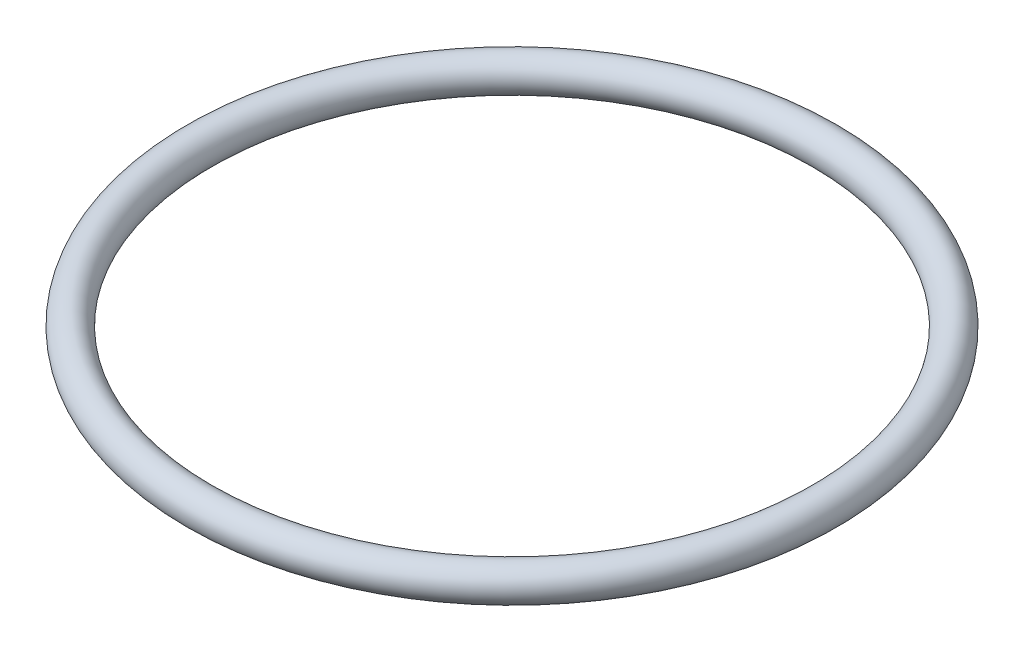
ISO-10303-21;
HEADER;
FILE_DESCRIPTION(('STEP AP214'),'2;1');
FILE_NAME('part.step','',(''),(''),'','','');
FILE_SCHEMA(('AUTOMOTIVE_DESIGN { 1 0 10303 214 1 1 1 1 }'));
ENDSEC;
DATA;
#1=APPLICATION_CONTEXT('core data for automotive mechanical design processes');
#2=APPLICATION_PROTOCOL_DEFINITION('international standard','automotive_design',2000,#1);
#3=PRODUCT_CONTEXT('',#1,'mechanical');
#4=PRODUCT('Part','Part','',(#3));
#5=PRODUCT_RELATED_PRODUCT_CATEGORY('part','',(#4));
#6=PRODUCT_DEFINITION_FORMATION('','',#4);
#7=PRODUCT_DEFINITION_CONTEXT('part definition',#1,'design');
#8=PRODUCT_DEFINITION('design','',#6,#7);
#9=PRODUCT_DEFINITION_SHAPE('','',#8);
#10=(LENGTH_UNIT() NAMED_UNIT(*) SI_UNIT(.MILLI.,.METRE.));
#11=(NAMED_UNIT(*) PLANE_ANGLE_UNIT() SI_UNIT($,.RADIAN.));
#12=(NAMED_UNIT(*) SI_UNIT($,.STERADIAN.) SOLID_ANGLE_UNIT());
#13=UNCERTAINTY_MEASURE_WITH_UNIT(LENGTH_MEASURE(1.E-05),#10,'distance_accuracy_value','');
#14=(GEOMETRIC_REPRESENTATION_CONTEXT(3) GLOBAL_UNCERTAINTY_ASSIGNED_CONTEXT((#13)) GLOBAL_UNIT_ASSIGNED_CONTEXT((#10,
#11,#12)) REPRESENTATION_CONTEXT('',''));
#15=CARTESIAN_POINT('',(0.,0.,0.));
#16=DIRECTION('',(0.,0.,1.));
#17=DIRECTION('',(1.,0.,0.));
#18=AXIS2_PLACEMENT_3D('',#15,#16,#17);
#19=CARTESIAN_POINT('',(0.,0.,0.));
#20=DIRECTION('',(0.,-1.,0.));
#21=DIRECTION('',(0.,0.,-1.));
#22=AXIS2_PLACEMENT_3D('',#19,#20,#21);
#23=TOROIDAL_SURFACE('',#22,23.7998,1.3081);
#24=CARTESIAN_POINT('',(0.,0.,-25.1079));
#25=VERTEX_POINT('',#24);
#26=VERTEX_LOOP('',#25);
#27=FACE_BOUND('',#26,.T.);
#28=ADVANCED_FACE('F30',(#27),#23,.T.);
#29=CLOSED_SHELL('',(#28));
#30=MANIFOLD_SOLID_BREP('B2',#29);
#31=ADVANCED_BREP_SHAPE_REPRESENTATION('',(#18,#30),#14);
#32=SHAPE_DEFINITION_REPRESENTATION(#9,#31);
ENDSEC;
END-ISO-10303-21;
